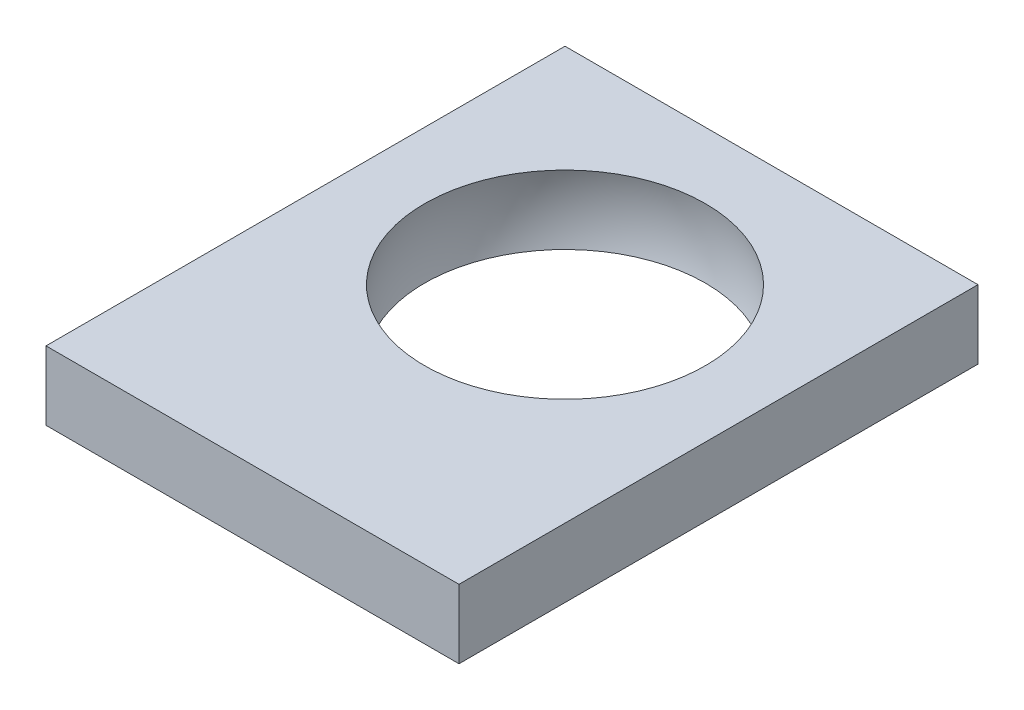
from build123d import *

# Parameters (mm, degrees)
ESQUISSE1_W        = 60
ESQUISSE1_H        = 10
BOSS_EXTRU_1_DEPTH = 70
ESQUISSE4_W        = 60
ESQUISSE4_H        = 10
BOSS_EXTRU_2_DEPTH = 5.401229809


with BuildPart() as part:
    # Esquisse1 → Boss.-Extru.1 (new body)
    with BuildSketch(Plane.XY):
        with Locations((30, 5)):
            Rectangle(ESQUISSE1_W, ESQUISSE1_H)
    extrude(amount=BOSS_EXTRU_1_DEPTH)

    # Esquisse3 → Enl_vement de mati_re-R_volution1 (revolve, cut)
    with BuildSketch(Plane(origin=(0, 5, 0), x_dir=(1, 0, 0), z_dir=(0, 1, 0))):
        with BuildLine():
            Line((9, -30), (51, -30))
            ThreePointArc((51, -30), (30, -9), (9, -30))
        make_face()
    revolve(axis=Axis((-17.54338298, 5, 30), (1, 0, 0)), mode=Mode.SUBTRACT)

    # Esquisse4 → Boss.-Extru.2 (add)
    with BuildSketch(Plane.XY.offset(70)):
        with Locations((30, 5)):
            Rectangle(ESQUISSE4_W, ESQUISSE4_H)
    extrude(amount=BOSS_EXTRU_2_DEPTH)


solid = part.part
